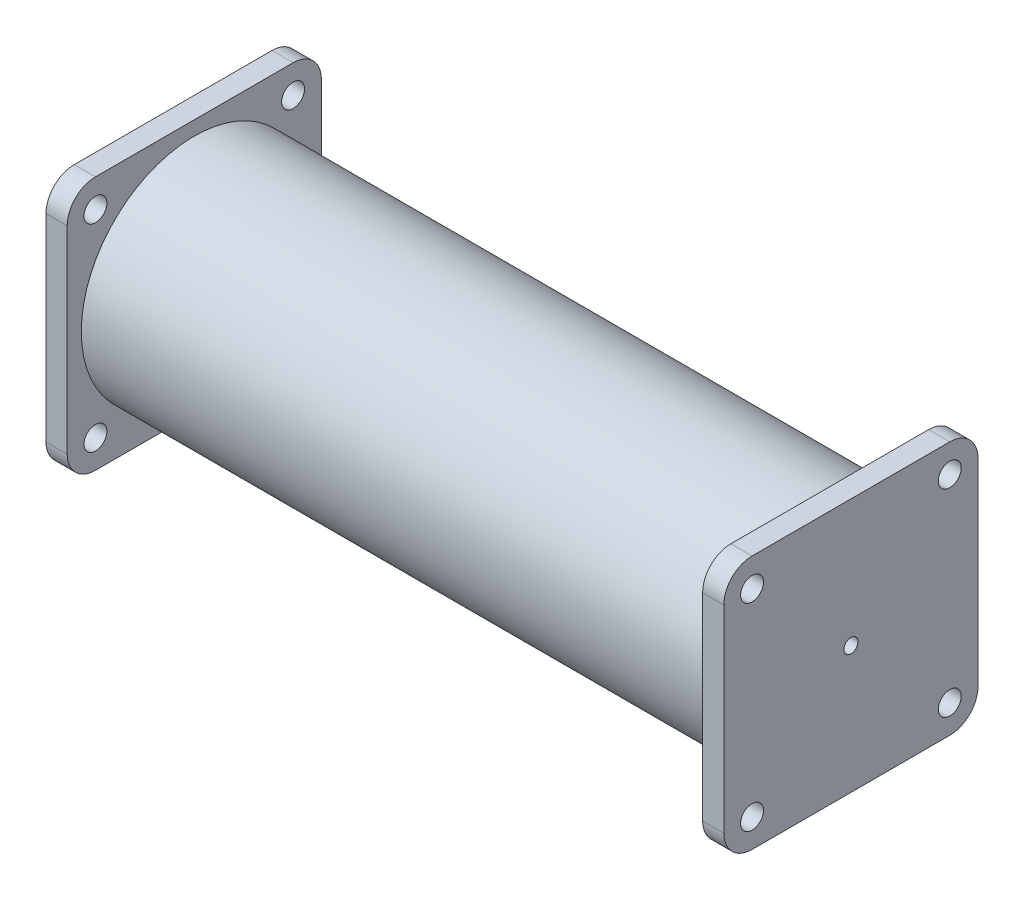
ISO-10303-21;
HEADER;
FILE_DESCRIPTION(('STEP AP214'),'2;1');
FILE_NAME('part.step','',(''),(''),'','','');
FILE_SCHEMA(('AUTOMOTIVE_DESIGN { 1 0 10303 214 1 1 1 1 }'));
ENDSEC;
DATA;
#1=APPLICATION_CONTEXT('core data for automotive mechanical design processes');
#2=APPLICATION_PROTOCOL_DEFINITION('international standard','automotive_design',2000,#1);
#3=PRODUCT_CONTEXT('',#1,'mechanical');
#4=PRODUCT('Part','Part','',(#3));
#5=PRODUCT_RELATED_PRODUCT_CATEGORY('part','',(#4));
#6=PRODUCT_DEFINITION_FORMATION('','',#4);
#7=PRODUCT_DEFINITION_CONTEXT('part definition',#1,'design');
#8=PRODUCT_DEFINITION('design','',#6,#7);
#9=PRODUCT_DEFINITION_SHAPE('','',#8);
#10=(LENGTH_UNIT() NAMED_UNIT(*) SI_UNIT(.MILLI.,.METRE.));
#11=(NAMED_UNIT(*) PLANE_ANGLE_UNIT() SI_UNIT($,.RADIAN.));
#12=(NAMED_UNIT(*) SI_UNIT($,.STERADIAN.) SOLID_ANGLE_UNIT());
#13=UNCERTAINTY_MEASURE_WITH_UNIT(LENGTH_MEASURE(1.E-05),#10,'distance_accuracy_value','');
#14=(GEOMETRIC_REPRESENTATION_CONTEXT(3) GLOBAL_UNCERTAINTY_ASSIGNED_CONTEXT((#13)) GLOBAL_UNIT_ASSIGNED_CONTEXT((#10,
#11,#12)) REPRESENTATION_CONTEXT('',''));
#15=CARTESIAN_POINT('',(0.,0.,0.));
#16=DIRECTION('',(0.,0.,1.));
#17=DIRECTION('',(1.,0.,0.));
#18=AXIS2_PLACEMENT_3D('',#15,#16,#17);
#19=CARTESIAN_POINT('',(146.05,0.,0.));
#20=DIRECTION('',(-1.,0.,0.));
#21=DIRECTION('',(0.,0.,1.));
#22=AXIS2_PLACEMENT_3D('',#19,#20,#21);
#23=CYLINDRICAL_SURFACE('',#22,50.8);
#24=CARTESIAN_POINT('',(-142.875,0.,0.));
#25=DIRECTION('',(-1.,0.,0.));
#26=DIRECTION('',(0.,0.,1.));
#27=AXIS2_PLACEMENT_3D('',#24,#25,#26);
#28=CIRCLE('',#27,50.8);
#29=CARTESIAN_POINT('',(-142.875,0.,50.8));
#30=VERTEX_POINT('',#29);
#31=EDGE_CURVE('E172',#30,#30,#28,.T.);
#32=ORIENTED_EDGE('',*,*,#31,.F.);
#33=EDGE_LOOP('',(#32));
#34=FACE_BOUND('',#33,.T.);
#35=CARTESIAN_POINT('',(142.875,0.,0.));
#36=DIRECTION('',(1.,0.,0.));
#37=DIRECTION('',(0.,0.,-1.));
#38=AXIS2_PLACEMENT_3D('',#35,#36,#37);
#39=CIRCLE('',#38,50.8);
#40=CARTESIAN_POINT('',(142.875,0.,-50.8));
#41=VERTEX_POINT('',#40);
#42=EDGE_CURVE('E168',#41,#41,#39,.T.);
#43=ORIENTED_EDGE('',*,*,#42,.F.);
#44=EDGE_LOOP('',(#43));
#45=FACE_BOUND('',#44,.T.);
#46=ADVANCED_FACE('F31',(#34,#45),#23,.T.);
#47=CARTESIAN_POINT('',(-142.875,-57.15,-57.15));
#48=DIRECTION('',(-1.,0.,0.));
#49=DIRECTION('',(0.,0.,1.));
#50=AXIS2_PLACEMENT_3D('',#47,#48,#49);
#51=PLANE('',#50);
#52=CARTESIAN_POINT('',(-142.875,44.45,44.45));
#53=DIRECTION('',(-1.,0.,0.));
#54=DIRECTION('',(0.,0.,1.));
#55=AXIS2_PLACEMENT_3D('',#52,#53,#54);
#56=CIRCLE('',#55,5.1562);
#57=CARTESIAN_POINT('',(-142.875,44.45,49.6062));
#58=VERTEX_POINT('',#57);
#59=EDGE_CURVE('E476',#58,#58,#56,.T.);
#60=ORIENTED_EDGE('',*,*,#59,.T.);
#61=EDGE_LOOP('',(#60));
#62=FACE_BOUND('',#61,.T.);
#63=CARTESIAN_POINT('',(-142.875,-44.45,44.45));
#64=DIRECTION('',(-1.,0.,0.));
#65=DIRECTION('',(0.,0.,1.));
#66=AXIS2_PLACEMENT_3D('',#63,#64,#65);
#67=CIRCLE('',#66,5.1562);
#68=CARTESIAN_POINT('',(-142.875,-44.45,49.6062));
#69=VERTEX_POINT('',#68);
#70=EDGE_CURVE('E466',#69,#69,#67,.T.);
#71=ORIENTED_EDGE('',*,*,#70,.T.);
#72=EDGE_LOOP('',(#71));
#73=FACE_BOUND('',#72,.T.);
#74=CARTESIAN_POINT('',(-142.875,-44.45,-44.45));
#75=DIRECTION('',(-1.,0.,0.));
#76=DIRECTION('',(0.,0.,1.));
#77=AXIS2_PLACEMENT_3D('',#74,#75,#76);
#78=CIRCLE('',#77,5.1562);
#79=CARTESIAN_POINT('',(-142.875,-44.45,-39.2938));
#80=VERTEX_POINT('',#79);
#81=EDGE_CURVE('E456',#80,#80,#78,.T.);
#82=ORIENTED_EDGE('',*,*,#81,.T.);
#83=EDGE_LOOP('',(#82));
#84=FACE_BOUND('',#83,.T.);
#85=CARTESIAN_POINT('',(-142.875,44.45,-44.45));
#86=DIRECTION('',(-1.,0.,0.));
#87=DIRECTION('',(0.,0.,1.));
#88=AXIS2_PLACEMENT_3D('',#85,#86,#87);
#89=CIRCLE('',#88,5.1562);
#90=CARTESIAN_POINT('',(-142.875,44.45,-39.2938));
#91=VERTEX_POINT('',#90);
#92=EDGE_CURVE('E444',#91,#91,#89,.T.);
#93=ORIENTED_EDGE('',*,*,#92,.T.);
#94=EDGE_LOOP('',(#93));
#95=FACE_BOUND('',#94,.T.);
#96=DIRECTION('',(0.,0.,1.));
#97=VECTOR('',#96,1.);
#98=CARTESIAN_POINT('',(-142.875,-57.15,57.15));
#99=LINE('',#98,#97);
#100=CARTESIAN_POINT('',(-142.875,-57.15,-44.45));
#101=VERTEX_POINT('',#100);
#102=CARTESIAN_POINT('',(-142.875,-57.15,44.45));
#103=VERTEX_POINT('',#102);
#104=EDGE_CURVE('E163',#101,#103,#99,.T.);
#105=ORIENTED_EDGE('',*,*,#104,.F.);
#106=CARTESIAN_POINT('',(-142.875,-44.45,-44.45));
#107=DIRECTION('',(-1.,0.,0.));
#108=DIRECTION('',(0.,0.,1.));
#109=AXIS2_PLACEMENT_3D('',#106,#107,#108);
#110=CIRCLE('',#109,12.7);
#111=CARTESIAN_POINT('',(-142.875,-44.45,-57.15));
#112=VERTEX_POINT('',#111);
#113=EDGE_CURVE('E193',#101,#112,#110,.F.);
#114=ORIENTED_EDGE('',*,*,#113,.T.);
#115=DIRECTION('',(0.,-1.,0.));
#116=VECTOR('',#115,1.);
#117=CARTESIAN_POINT('',(-142.875,57.15,-57.15));
#118=LINE('',#117,#116);
#119=CARTESIAN_POINT('',(-142.875,44.45,-57.15));
#120=VERTEX_POINT('',#119);
#121=EDGE_CURVE('E280',#120,#112,#118,.T.);
#122=ORIENTED_EDGE('',*,*,#121,.F.);
#123=CARTESIAN_POINT('',(-142.875,44.45,-44.45));
#124=DIRECTION('',(-1.,0.,0.));
#125=DIRECTION('',(0.,0.,1.));
#126=AXIS2_PLACEMENT_3D('',#123,#124,#125);
#127=CIRCLE('',#126,12.7);
#128=CARTESIAN_POINT('',(-142.875,57.15,-44.45));
#129=VERTEX_POINT('',#128);
#130=EDGE_CURVE('E167',#120,#129,#127,.F.);
#131=ORIENTED_EDGE('',*,*,#130,.T.);
#132=DIRECTION('',(0.,0.,-1.));
#133=VECTOR('',#132,1.);
#134=CARTESIAN_POINT('',(-142.875,57.15,57.15));
#135=LINE('',#134,#133);
#136=CARTESIAN_POINT('',(-142.875,57.15,44.45));
#137=VERTEX_POINT('',#136);
#138=EDGE_CURVE('E277',#137,#129,#135,.T.);
#139=ORIENTED_EDGE('',*,*,#138,.F.);
#140=CARTESIAN_POINT('',(-142.875,44.45,44.45));
#141=DIRECTION('',(-1.,0.,0.));
#142=DIRECTION('',(0.,0.,1.));
#143=AXIS2_PLACEMENT_3D('',#140,#141,#142);
#144=CIRCLE('',#143,12.7);
#145=CARTESIAN_POINT('',(-142.875,44.45,57.15));
#146=VERTEX_POINT('',#145);
#147=EDGE_CURVE('E189',#137,#146,#144,.F.);
#148=ORIENTED_EDGE('',*,*,#147,.T.);
#149=DIRECTION('',(0.,1.,0.));
#150=VECTOR('',#149,1.);
#151=CARTESIAN_POINT('',(-142.875,57.15,57.15));
#152=LINE('',#151,#150);
#153=CARTESIAN_POINT('',(-142.875,-44.45,57.15));
#154=VERTEX_POINT('',#153);
#155=EDGE_CURVE('E274',#154,#146,#152,.T.);
#156=ORIENTED_EDGE('',*,*,#155,.F.);
#157=CARTESIAN_POINT('',(-142.875,-44.45,44.45));
#158=DIRECTION('',(-1.,0.,0.));
#159=DIRECTION('',(0.,0.,1.));
#160=AXIS2_PLACEMENT_3D('',#157,#158,#159);
#161=CIRCLE('',#160,12.7);
#162=EDGE_CURVE('E191',#154,#103,#161,.F.);
#163=ORIENTED_EDGE('',*,*,#162,.T.);
#164=EDGE_LOOP('',(#105,#114,#122,#131,#139,#148,#156,#163));
#165=FACE_BOUND('',#164,.T.);
#166=ORIENTED_EDGE('',*,*,#31,.T.);
#167=EDGE_LOOP('',(#166));
#168=FACE_BOUND('',#167,.T.);
#169=ADVANCED_FACE('F314',(#62,#73,#84,#95,#165,#168),#51,.F.);
#170=CARTESIAN_POINT('',(-142.875,-57.15,57.15));
#171=DIRECTION('',(0.,-1.,0.));
#172=DIRECTION('',(0.,0.,-1.));
#173=AXIS2_PLACEMENT_3D('',#170,#171,#172);
#174=PLANE('',#173);
#175=DIRECTION('',(0.,0.,1.));
#176=VECTOR('',#175,1.);
#177=CARTESIAN_POINT('',(-152.4,-57.15,57.15));
#178=LINE('',#177,#176);
#179=CARTESIAN_POINT('',(-152.4,-57.15,-44.45));
#180=VERTEX_POINT('',#179);
#181=CARTESIAN_POINT('',(-152.4,-57.15,44.45));
#182=VERTEX_POINT('',#181);
#183=EDGE_CURVE('E265',#180,#182,#178,.T.);
#184=ORIENTED_EDGE('',*,*,#183,.F.);
#185=DIRECTION('',(-1.,0.,0.));
#186=VECTOR('',#185,1.);
#187=CARTESIAN_POINT('',(-142.875,-57.15,-44.45));
#188=LINE('',#187,#186);
#189=EDGE_CURVE('E186',#180,#101,#188,.F.);
#190=ORIENTED_EDGE('',*,*,#189,.T.);
#191=ORIENTED_EDGE('',*,*,#104,.T.);
#192=DIRECTION('',(-1.,0.,0.));
#193=VECTOR('',#192,1.);
#194=CARTESIAN_POINT('',(-142.875,-57.15,44.45));
#195=LINE('',#194,#193);
#196=EDGE_CURVE('E183',#103,#182,#195,.T.);
#197=ORIENTED_EDGE('',*,*,#196,.T.);
#198=EDGE_LOOP('',(#184,#190,#191,#197));
#199=FACE_BOUND('',#198,.T.);
#200=ADVANCED_FACE('F319',(#199),#174,.T.);
#201=CARTESIAN_POINT('',(-142.875,57.15,-57.15));
#202=DIRECTION('',(0.,0.,-1.));
#203=DIRECTION('',(-1.,0.,0.));
#204=AXIS2_PLACEMENT_3D('',#201,#202,#203);
#205=PLANE('',#204);
#206=ORIENTED_EDGE('',*,*,#121,.T.);
#207=DIRECTION('',(-1.,0.,0.));
#208=VECTOR('',#207,1.);
#209=CARTESIAN_POINT('',(-142.875,-44.45,-57.15));
#210=LINE('',#209,#208);
#211=CARTESIAN_POINT('',(-152.4,-44.45,-57.15));
#212=VERTEX_POINT('',#211);
#213=EDGE_CURVE('E154',#112,#212,#210,.T.);
#214=ORIENTED_EDGE('',*,*,#213,.T.);
#215=DIRECTION('',(0.,-1.,0.));
#216=VECTOR('',#215,1.);
#217=CARTESIAN_POINT('',(-152.4,57.15,-57.15));
#218=LINE('',#217,#216);
#219=CARTESIAN_POINT('',(-152.4,44.45,-57.15));
#220=VERTEX_POINT('',#219);
#221=EDGE_CURVE('E146',#220,#212,#218,.T.);
#222=ORIENTED_EDGE('',*,*,#221,.F.);
#223=DIRECTION('',(-1.,0.,0.));
#224=VECTOR('',#223,1.);
#225=CARTESIAN_POINT('',(-142.875,44.45,-57.15));
#226=LINE('',#225,#224);
#227=EDGE_CURVE('E160',#220,#120,#226,.F.);
#228=ORIENTED_EDGE('',*,*,#227,.T.);
#229=EDGE_LOOP('',(#206,#214,#222,#228));
#230=FACE_BOUND('',#229,.T.);
#231=ADVANCED_FACE('F159',(#230),#205,.T.);
#232=CARTESIAN_POINT('',(-142.875,57.15,57.15));
#233=DIRECTION('',(0.,1.,0.));
#234=DIRECTION('',(0.,0.,1.));
#235=AXIS2_PLACEMENT_3D('',#232,#233,#234);
#236=PLANE('',#235);
#237=DIRECTION('',(0.,0.,-1.));
#238=VECTOR('',#237,1.);
#239=CARTESIAN_POINT('',(-152.4,57.15,57.15));
#240=LINE('',#239,#238);
#241=CARTESIAN_POINT('',(-152.4,57.15,44.45));
#242=VERTEX_POINT('',#241);
#243=CARTESIAN_POINT('',(-152.4,57.15,-44.45));
#244=VERTEX_POINT('',#243);
#245=EDGE_CURVE('E148',#242,#244,#240,.T.);
#246=ORIENTED_EDGE('',*,*,#245,.F.);
#247=DIRECTION('',(-1.,0.,0.));
#248=VECTOR('',#247,1.);
#249=CARTESIAN_POINT('',(-142.875,57.15,44.45));
#250=LINE('',#249,#248);
#251=EDGE_CURVE('E202',#242,#137,#250,.F.);
#252=ORIENTED_EDGE('',*,*,#251,.T.);
#253=ORIENTED_EDGE('',*,*,#138,.T.);
#254=DIRECTION('',(-1.,0.,0.));
#255=VECTOR('',#254,1.);
#256=CARTESIAN_POINT('',(-142.875,57.15,-44.45));
#257=LINE('',#256,#255);
#258=EDGE_CURVE('E200',#129,#244,#257,.T.);
#259=ORIENTED_EDGE('',*,*,#258,.T.);
#260=EDGE_LOOP('',(#246,#252,#253,#259));
#261=FACE_BOUND('',#260,.T.);
#262=ADVANCED_FACE('F517',(#261),#236,.T.);
#263=CARTESIAN_POINT('',(-142.875,57.15,57.15));
#264=DIRECTION('',(0.,0.,1.));
#265=DIRECTION('',(1.,0.,0.));
#266=AXIS2_PLACEMENT_3D('',#263,#264,#265);
#267=PLANE('',#266);
#268=DIRECTION('',(0.,1.,0.));
#269=VECTOR('',#268,1.);
#270=CARTESIAN_POINT('',(-152.4,57.15,57.15));
#271=LINE('',#270,#269);
#272=CARTESIAN_POINT('',(-152.4,-44.45,57.15));
#273=VERTEX_POINT('',#272);
#274=CARTESIAN_POINT('',(-152.4,44.45,57.15));
#275=VERTEX_POINT('',#274);
#276=EDGE_CURVE('E268',#273,#275,#271,.T.);
#277=ORIENTED_EDGE('',*,*,#276,.F.);
#278=DIRECTION('',(-1.,0.,0.));
#279=VECTOR('',#278,1.);
#280=CARTESIAN_POINT('',(-142.875,-44.45,57.15));
#281=LINE('',#280,#279);
#282=EDGE_CURVE('E198',#273,#154,#281,.F.);
#283=ORIENTED_EDGE('',*,*,#282,.T.);
#284=ORIENTED_EDGE('',*,*,#155,.T.);
#285=DIRECTION('',(-1.,0.,0.));
#286=VECTOR('',#285,1.);
#287=CARTESIAN_POINT('',(-142.875,44.45,57.15));
#288=LINE('',#287,#286);
#289=EDGE_CURVE('E195',#146,#275,#288,.T.);
#290=ORIENTED_EDGE('',*,*,#289,.T.);
#291=EDGE_LOOP('',(#277,#283,#284,#290));
#292=FACE_BOUND('',#291,.T.);
#293=ADVANCED_FACE('F489',(#292),#267,.T.);
#294=CARTESIAN_POINT('',(-152.4,0.,0.));
#295=DIRECTION('',(-1.,0.,0.));
#296=DIRECTION('',(0.,0.,1.));
#297=AXIS2_PLACEMENT_3D('',#294,#295,#296);
#298=PLANE('',#297);
#299=CARTESIAN_POINT('',(-152.4,44.45,44.45));
#300=DIRECTION('',(-1.,0.,0.));
#301=DIRECTION('',(0.,0.,-1.));
#302=AXIS2_PLACEMENT_3D('',#299,#300,#301);
#303=CIRCLE('',#302,5.1562);
#304=CARTESIAN_POINT('',(-152.4,44.45,39.2938));
#305=VERTEX_POINT('',#304);
#306=EDGE_CURVE('E482',#305,#305,#303,.T.);
#307=ORIENTED_EDGE('',*,*,#306,.F.);
#308=EDGE_LOOP('',(#307));
#309=FACE_BOUND('',#308,.T.);
#310=CARTESIAN_POINT('',(-152.4,-44.45,44.45));
#311=DIRECTION('',(-1.,0.,0.));
#312=DIRECTION('',(0.,0.,1.));
#313=AXIS2_PLACEMENT_3D('',#310,#311,#312);
#314=CIRCLE('',#313,5.1562);
#315=CARTESIAN_POINT('',(-152.4,-44.45,49.6062));
#316=VERTEX_POINT('',#315);
#317=EDGE_CURVE('E473',#316,#316,#314,.T.);
#318=ORIENTED_EDGE('',*,*,#317,.F.);
#319=EDGE_LOOP('',(#318));
#320=FACE_BOUND('',#319,.T.);
#321=CARTESIAN_POINT('',(-152.4,-44.45,-44.45));
#322=DIRECTION('',(-1.,0.,0.));
#323=DIRECTION('',(0.,0.,-1.));
#324=AXIS2_PLACEMENT_3D('',#321,#322,#323);
#325=CIRCLE('',#324,5.1562);
#326=CARTESIAN_POINT('',(-152.4,-44.45,-49.6062));
#327=VERTEX_POINT('',#326);
#328=EDGE_CURVE('E463',#327,#327,#325,.T.);
#329=ORIENTED_EDGE('',*,*,#328,.F.);
#330=EDGE_LOOP('',(#329));
#331=FACE_BOUND('',#330,.T.);
#332=CARTESIAN_POINT('',(-152.4,44.45,-44.45));
#333=DIRECTION('',(-1.,0.,0.));
#334=DIRECTION('',(0.,0.,1.));
#335=AXIS2_PLACEMENT_3D('',#332,#333,#334);
#336=CIRCLE('',#335,5.1562);
#337=CARTESIAN_POINT('',(-152.4,44.45,-39.2938));
#338=VERTEX_POINT('',#337);
#339=EDGE_CURVE('E453',#338,#338,#336,.T.);
#340=ORIENTED_EDGE('',*,*,#339,.F.);
#341=EDGE_LOOP('',(#340));
#342=FACE_BOUND('',#341,.T.);
#343=CARTESIAN_POINT('',(-152.4,0.,0.));
#344=DIRECTION('',(-1.,0.,0.));
#345=DIRECTION('',(0.,0.,1.));
#346=AXIS2_PLACEMENT_3D('',#343,#344,#345);
#347=CIRCLE('',#346,3.175);
#348=CARTESIAN_POINT('',(-152.4,0.,3.175));
#349=VERTEX_POINT('',#348);
#350=EDGE_CURVE('E351',#349,#349,#347,.T.);
#351=ORIENTED_EDGE('',*,*,#350,.F.);
#352=EDGE_LOOP('',(#351));
#353=FACE_BOUND('',#352,.T.);
#354=ORIENTED_EDGE('',*,*,#221,.T.);
#355=CARTESIAN_POINT('',(-152.4,-44.45,-44.45));
#356=DIRECTION('',(-1.,0.,0.));
#357=DIRECTION('',(0.,0.,1.));
#358=AXIS2_PLACEMENT_3D('',#355,#356,#357);
#359=CIRCLE('',#358,12.7);
#360=EDGE_CURVE('E181',#212,#180,#359,.T.);
#361=ORIENTED_EDGE('',*,*,#360,.T.);
#362=ORIENTED_EDGE('',*,*,#183,.T.);
#363=CARTESIAN_POINT('',(-152.4,-44.45,44.45));
#364=DIRECTION('',(-1.,0.,0.));
#365=DIRECTION('',(0.,0.,1.));
#366=AXIS2_PLACEMENT_3D('',#363,#364,#365);
#367=CIRCLE('',#366,12.7);
#368=EDGE_CURVE('E179',#182,#273,#367,.T.);
#369=ORIENTED_EDGE('',*,*,#368,.T.);
#370=ORIENTED_EDGE('',*,*,#276,.T.);
#371=CARTESIAN_POINT('',(-152.4,44.45,44.45));
#372=DIRECTION('',(-1.,0.,0.));
#373=DIRECTION('',(0.,0.,1.));
#374=AXIS2_PLACEMENT_3D('',#371,#372,#373);
#375=CIRCLE('',#374,12.7);
#376=EDGE_CURVE('E153',#275,#242,#375,.T.);
#377=ORIENTED_EDGE('',*,*,#376,.T.);
#378=ORIENTED_EDGE('',*,*,#245,.T.);
#379=CARTESIAN_POINT('',(-152.4,44.45,-44.45));
#380=DIRECTION('',(-1.,0.,0.));
#381=DIRECTION('',(0.,0.,1.));
#382=AXIS2_PLACEMENT_3D('',#379,#380,#381);
#383=CIRCLE('',#382,12.7);
#384=EDGE_CURVE('E143',#244,#220,#383,.T.);
#385=ORIENTED_EDGE('',*,*,#384,.T.);
#386=EDGE_LOOP('',(#354,#361,#362,#369,#370,#377,#378,#385));
#387=FACE_BOUND('',#386,.T.);
#388=ADVANCED_FACE('F145',(#309,#320,#331,#342,#353,#387),#298,.T.);
#389=CARTESIAN_POINT('',(142.875,-57.15,-57.15));
#390=DIRECTION('',(1.,0.,0.));
#391=DIRECTION('',(0.,0.,1.));
#392=AXIS2_PLACEMENT_3D('',#389,#390,#391);
#393=PLANE('',#392);
#394=CARTESIAN_POINT('',(142.875,44.45,44.45));
#395=DIRECTION('',(1.,0.,0.));
#396=DIRECTION('',(0.,0.,-1.));
#397=AXIS2_PLACEMENT_3D('',#394,#395,#396);
#398=CIRCLE('',#397,5.1562);
#399=CARTESIAN_POINT('',(142.875,44.45,39.2938));
#400=VERTEX_POINT('',#399);
#401=EDGE_CURVE('E478',#400,#400,#398,.T.);
#402=ORIENTED_EDGE('',*,*,#401,.T.);
#403=EDGE_LOOP('',(#402));
#404=FACE_BOUND('',#403,.T.);
#405=CARTESIAN_POINT('',(142.875,-44.45,44.45));
#406=DIRECTION('',(1.,0.,0.));
#407=DIRECTION('',(0.,0.,-1.));
#408=AXIS2_PLACEMENT_3D('',#405,#406,#407);
#409=CIRCLE('',#408,5.1562);
#410=CARTESIAN_POINT('',(142.875,-44.45,39.2938));
#411=VERTEX_POINT('',#410);
#412=EDGE_CURVE('E469',#411,#411,#409,.T.);
#413=ORIENTED_EDGE('',*,*,#412,.T.);
#414=EDGE_LOOP('',(#413));
#415=FACE_BOUND('',#414,.T.);
#416=CARTESIAN_POINT('',(142.875,-44.45,-44.45));
#417=DIRECTION('',(1.,0.,0.));
#418=DIRECTION('',(0.,0.,-1.));
#419=AXIS2_PLACEMENT_3D('',#416,#417,#418);
#420=CIRCLE('',#419,5.1562);
#421=CARTESIAN_POINT('',(142.875,-44.45,-49.6062));
#422=VERTEX_POINT('',#421);
#423=EDGE_CURVE('E459',#422,#422,#420,.T.);
#424=ORIENTED_EDGE('',*,*,#423,.T.);
#425=EDGE_LOOP('',(#424));
#426=FACE_BOUND('',#425,.T.);
#427=CARTESIAN_POINT('',(142.875,44.45,-44.45));
#428=DIRECTION('',(1.,0.,0.));
#429=DIRECTION('',(0.,0.,-1.));
#430=AXIS2_PLACEMENT_3D('',#427,#428,#429);
#431=CIRCLE('',#430,5.1562);
#432=CARTESIAN_POINT('',(142.875,44.45,-49.6062));
#433=VERTEX_POINT('',#432);
#434=EDGE_CURVE('E446',#433,#433,#431,.T.);
#435=ORIENTED_EDGE('',*,*,#434,.T.);
#436=EDGE_LOOP('',(#435));
#437=FACE_BOUND('',#436,.T.);
#438=DIRECTION('',(0.,-1.,0.));
#439=VECTOR('',#438,1.);
#440=CARTESIAN_POINT('',(142.875,57.15,-57.15));
#441=LINE('',#440,#439);
#442=CARTESIAN_POINT('',(142.875,44.45,-57.15));
#443=VERTEX_POINT('',#442);
#444=CARTESIAN_POINT('',(142.875,-44.45,-57.15));
#445=VERTEX_POINT('',#444);
#446=EDGE_CURVE('E258',#443,#445,#441,.T.);
#447=ORIENTED_EDGE('',*,*,#446,.T.);
#448=CARTESIAN_POINT('',(142.875,-44.45,-44.45));
#449=DIRECTION('',(1.,0.,0.));
#450=DIRECTION('',(0.,0.,-1.));
#451=AXIS2_PLACEMENT_3D('',#448,#449,#450);
#452=CIRCLE('',#451,12.7);
#453=CARTESIAN_POINT('',(142.875,-57.15,-44.45));
#454=VERTEX_POINT('',#453);
#455=EDGE_CURVE('E227',#445,#454,#452,.F.);
#456=ORIENTED_EDGE('',*,*,#455,.T.);
#457=DIRECTION('',(0.,0.,1.));
#458=VECTOR('',#457,1.);
#459=CARTESIAN_POINT('',(142.875,-57.15,57.15));
#460=LINE('',#459,#458);
#461=CARTESIAN_POINT('',(142.875,-57.15,44.45));
#462=VERTEX_POINT('',#461);
#463=EDGE_CURVE('E249',#454,#462,#460,.T.);
#464=ORIENTED_EDGE('',*,*,#463,.T.);
#465=CARTESIAN_POINT('',(142.875,-44.45,44.45));
#466=DIRECTION('',(1.,0.,0.));
#467=DIRECTION('',(0.,0.,-1.));
#468=AXIS2_PLACEMENT_3D('',#465,#466,#467);
#469=CIRCLE('',#468,12.7);
#470=CARTESIAN_POINT('',(142.875,-44.45,57.15));
#471=VERTEX_POINT('',#470);
#472=EDGE_CURVE('E225',#462,#471,#469,.F.);
#473=ORIENTED_EDGE('',*,*,#472,.T.);
#474=DIRECTION('',(0.,1.,0.));
#475=VECTOR('',#474,1.);
#476=CARTESIAN_POINT('',(142.875,57.15,57.15));
#477=LINE('',#476,#475);
#478=CARTESIAN_POINT('',(142.875,44.45,57.15));
#479=VERTEX_POINT('',#478);
#480=EDGE_CURVE('E262',#471,#479,#477,.T.);
#481=ORIENTED_EDGE('',*,*,#480,.T.);
#482=CARTESIAN_POINT('',(142.875,44.45,44.45));
#483=DIRECTION('',(1.,0.,0.));
#484=DIRECTION('',(0.,0.,-1.));
#485=AXIS2_PLACEMENT_3D('',#482,#483,#484);
#486=CIRCLE('',#485,12.7);
#487=CARTESIAN_POINT('',(142.875,57.15,44.45));
#488=VERTEX_POINT('',#487);
#489=EDGE_CURVE('E50',#479,#488,#486,.F.);
#490=ORIENTED_EDGE('',*,*,#489,.T.);
#491=DIRECTION('',(0.,0.,-1.));
#492=VECTOR('',#491,1.);
#493=CARTESIAN_POINT('',(142.875,57.15,57.15));
#494=LINE('',#493,#492);
#495=CARTESIAN_POINT('',(142.875,57.15,-44.45));
#496=VERTEX_POINT('',#495);
#497=EDGE_CURVE('E238',#488,#496,#494,.T.);
#498=ORIENTED_EDGE('',*,*,#497,.T.);
#499=CARTESIAN_POINT('',(142.875,44.45,-44.45));
#500=DIRECTION('',(1.,0.,0.));
#501=DIRECTION('',(0.,0.,-1.));
#502=AXIS2_PLACEMENT_3D('',#499,#500,#501);
#503=CIRCLE('',#502,12.7);
#504=EDGE_CURVE('E223',#496,#443,#503,.F.);
#505=ORIENTED_EDGE('',*,*,#504,.T.);
#506=EDGE_LOOP('',(#447,#456,#464,#473,#481,#490,#498,#505));
#507=FACE_BOUND('',#506,.T.);
#508=ORIENTED_EDGE('',*,*,#42,.T.);
#509=EDGE_LOOP('',(#508));
#510=FACE_BOUND('',#509,.T.);
#511=ADVANCED_FACE('F296',(#404,#415,#426,#437,#507,#510),#393,.F.);
#512=CARTESIAN_POINT('',(142.875,-57.15,57.15));
#513=DIRECTION('',(0.,1.,0.));
#514=DIRECTION('',(0.,0.,1.));
#515=AXIS2_PLACEMENT_3D('',#512,#513,#514);
#516=PLANE('',#515);
#517=ORIENTED_EDGE('',*,*,#463,.F.);
#518=DIRECTION('',(1.,0.,0.));
#519=VECTOR('',#518,1.);
#520=CARTESIAN_POINT('',(142.875,-57.15,-44.45));
#521=LINE('',#520,#519);
#522=CARTESIAN_POINT('',(152.4,-57.15,-44.45));
#523=VERTEX_POINT('',#522);
#524=EDGE_CURVE('E206',#454,#523,#521,.T.);
#525=ORIENTED_EDGE('',*,*,#524,.T.);
#526=DIRECTION('',(0.,0.,1.));
#527=VECTOR('',#526,1.);
#528=CARTESIAN_POINT('',(152.4,-57.15,57.15));
#529=LINE('',#528,#527);
#530=CARTESIAN_POINT('',(152.4,-57.15,44.45));
#531=VERTEX_POINT('',#530);
#532=EDGE_CURVE('E252',#523,#531,#529,.T.);
#533=ORIENTED_EDGE('',*,*,#532,.T.);
#534=DIRECTION('',(1.,0.,0.));
#535=VECTOR('',#534,1.);
#536=CARTESIAN_POINT('',(142.875,-57.15,44.45));
#537=LINE('',#536,#535);
#538=EDGE_CURVE('E204',#531,#462,#537,.F.);
#539=ORIENTED_EDGE('',*,*,#538,.T.);
#540=EDGE_LOOP('',(#517,#525,#533,#539));
#541=FACE_BOUND('',#540,.T.);
#542=ADVANCED_FACE('F311',(#541),#516,.F.);
#543=CARTESIAN_POINT('',(142.875,57.15,57.15));
#544=DIRECTION('',(0.,0.,-1.));
#545=DIRECTION('',(-1.,0.,0.));
#546=AXIS2_PLACEMENT_3D('',#543,#544,#545);
#547=PLANE('',#546);
#548=ORIENTED_EDGE('',*,*,#480,.F.);
#549=DIRECTION('',(1.,0.,0.));
#550=VECTOR('',#549,1.);
#551=CARTESIAN_POINT('',(142.875,-44.45,57.15));
#552=LINE('',#551,#550);
#553=CARTESIAN_POINT('',(152.4,-44.45,57.15));
#554=VERTEX_POINT('',#553);
#555=EDGE_CURVE('E231',#471,#554,#552,.T.);
#556=ORIENTED_EDGE('',*,*,#555,.T.);
#557=DIRECTION('',(0.,1.,0.));
#558=VECTOR('',#557,1.);
#559=CARTESIAN_POINT('',(152.4,57.15,57.15));
#560=LINE('',#559,#558);
#561=CARTESIAN_POINT('',(152.4,44.45,57.15));
#562=VERTEX_POINT('',#561);
#563=EDGE_CURVE('E246',#554,#562,#560,.T.);
#564=ORIENTED_EDGE('',*,*,#563,.T.);
#565=DIRECTION('',(1.,0.,0.));
#566=VECTOR('',#565,1.);
#567=CARTESIAN_POINT('',(142.875,44.45,57.15));
#568=LINE('',#567,#566);
#569=EDGE_CURVE('E229',#562,#479,#568,.F.);
#570=ORIENTED_EDGE('',*,*,#569,.T.);
#571=EDGE_LOOP('',(#548,#556,#564,#570));
#572=FACE_BOUND('',#571,.T.);
#573=ADVANCED_FACE('F369',(#572),#547,.F.);
#574=CARTESIAN_POINT('',(142.875,57.15,57.15));
#575=DIRECTION('',(0.,-1.,0.));
#576=DIRECTION('',(0.,0.,-1.));
#577=AXIS2_PLACEMENT_3D('',#574,#575,#576);
#578=PLANE('',#577);
#579=DIRECTION('',(0.,0.,-1.));
#580=VECTOR('',#579,1.);
#581=CARTESIAN_POINT('',(152.4,57.15,57.15));
#582=LINE('',#581,#580);
#583=CARTESIAN_POINT('',(152.4,57.15,44.45));
#584=VERTEX_POINT('',#583);
#585=CARTESIAN_POINT('',(152.4,57.15,-44.45));
#586=VERTEX_POINT('',#585);
#587=EDGE_CURVE('E237',#584,#586,#582,.T.);
#588=ORIENTED_EDGE('',*,*,#587,.T.);
#589=DIRECTION('',(1.,0.,0.));
#590=VECTOR('',#589,1.);
#591=CARTESIAN_POINT('',(142.875,57.15,-44.45));
#592=LINE('',#591,#590);
#593=EDGE_CURVE('E11',#586,#496,#592,.F.);
#594=ORIENTED_EDGE('',*,*,#593,.T.);
#595=ORIENTED_EDGE('',*,*,#497,.F.);
#596=DIRECTION('',(1.,0.,0.));
#597=VECTOR('',#596,1.);
#598=CARTESIAN_POINT('',(142.875,57.15,44.45));
#599=LINE('',#598,#597);
#600=EDGE_CURVE('E38',#488,#584,#599,.T.);
#601=ORIENTED_EDGE('',*,*,#600,.T.);
#602=EDGE_LOOP('',(#588,#594,#595,#601));
#603=FACE_BOUND('',#602,.T.);
#604=ADVANCED_FACE('F236',(#603),#578,.F.);
#605=CARTESIAN_POINT('',(142.875,57.15,-57.15));
#606=DIRECTION('',(0.,0.,1.));
#607=DIRECTION('',(1.,0.,0.));
#608=AXIS2_PLACEMENT_3D('',#605,#606,#607);
#609=PLANE('',#608);
#610=DIRECTION('',(0.,-1.,0.));
#611=VECTOR('',#610,1.);
#612=CARTESIAN_POINT('',(152.4,57.15,-57.15));
#613=LINE('',#612,#611);
#614=CARTESIAN_POINT('',(152.4,44.45,-57.15));
#615=VERTEX_POINT('',#614);
#616=CARTESIAN_POINT('',(152.4,-44.45,-57.15));
#617=VERTEX_POINT('',#616);
#618=EDGE_CURVE('E247',#615,#617,#613,.T.);
#619=ORIENTED_EDGE('',*,*,#618,.T.);
#620=DIRECTION('',(1.,0.,0.));
#621=VECTOR('',#620,1.);
#622=CARTESIAN_POINT('',(142.875,-44.45,-57.15));
#623=LINE('',#622,#621);
#624=EDGE_CURVE('E220',#617,#445,#623,.F.);
#625=ORIENTED_EDGE('',*,*,#624,.T.);
#626=ORIENTED_EDGE('',*,*,#446,.F.);
#627=DIRECTION('',(1.,0.,0.));
#628=VECTOR('',#627,1.);
#629=CARTESIAN_POINT('',(142.875,44.45,-57.15));
#630=LINE('',#629,#628);
#631=EDGE_CURVE('E217',#443,#615,#630,.T.);
#632=ORIENTED_EDGE('',*,*,#631,.T.);
#633=EDGE_LOOP('',(#619,#625,#626,#632));
#634=FACE_BOUND('',#633,.T.);
#635=ADVANCED_FACE('F417',(#634),#609,.F.);
#636=CARTESIAN_POINT('',(152.4,-57.15,-57.15));
#637=DIRECTION('',(1.,0.,0.));
#638=DIRECTION('',(0.,0.,1.));
#639=AXIS2_PLACEMENT_3D('',#636,#637,#638);
#640=PLANE('',#639);
#641=CARTESIAN_POINT('',(152.4,44.45,44.45));
#642=DIRECTION('',(-1.,0.,0.));
#643=DIRECTION('',(0.,0.,-1.));
#644=AXIS2_PLACEMENT_3D('',#641,#642,#643);
#645=CIRCLE('',#644,5.1562);
#646=CARTESIAN_POINT('',(152.4,44.45,39.2938));
#647=VERTEX_POINT('',#646);
#648=EDGE_CURVE('E429',#647,#647,#645,.T.);
#649=ORIENTED_EDGE('',*,*,#648,.T.);
#650=EDGE_LOOP('',(#649));
#651=FACE_BOUND('',#650,.T.);
#652=CARTESIAN_POINT('',(152.4,-44.45,44.45));
#653=DIRECTION('',(-1.,0.,0.));
#654=DIRECTION('',(0.,0.,1.));
#655=AXIS2_PLACEMENT_3D('',#652,#653,#654);
#656=CIRCLE('',#655,5.1562);
#657=CARTESIAN_POINT('',(152.4,-44.45,49.6062));
#658=VERTEX_POINT('',#657);
#659=EDGE_CURVE('E433',#658,#658,#656,.T.);
#660=ORIENTED_EDGE('',*,*,#659,.T.);
#661=EDGE_LOOP('',(#660));
#662=FACE_BOUND('',#661,.T.);
#663=CARTESIAN_POINT('',(152.4,-44.45,-44.45));
#664=DIRECTION('',(-1.,0.,0.));
#665=DIRECTION('',(0.,0.,-1.));
#666=AXIS2_PLACEMENT_3D('',#663,#664,#665);
#667=CIRCLE('',#666,5.1562);
#668=CARTESIAN_POINT('',(152.4,-44.45,-49.6062));
#669=VERTEX_POINT('',#668);
#670=EDGE_CURVE('E437',#669,#669,#667,.T.);
#671=ORIENTED_EDGE('',*,*,#670,.T.);
#672=EDGE_LOOP('',(#671));
#673=FACE_BOUND('',#672,.T.);
#674=CARTESIAN_POINT('',(152.4,44.45,-44.45));
#675=DIRECTION('',(-1.,0.,0.));
#676=DIRECTION('',(0.,0.,1.));
#677=AXIS2_PLACEMENT_3D('',#674,#675,#676);
#678=CIRCLE('',#677,5.1562);
#679=CARTESIAN_POINT('',(152.4,44.45,-39.2938));
#680=VERTEX_POINT('',#679);
#681=EDGE_CURVE('E441',#680,#680,#678,.T.);
#682=ORIENTED_EDGE('',*,*,#681,.T.);
#683=EDGE_LOOP('',(#682));
#684=FACE_BOUND('',#683,.T.);
#685=CARTESIAN_POINT('',(152.4,0.,0.));
#686=DIRECTION('',(-1.,0.,0.));
#687=DIRECTION('',(0.,0.,1.));
#688=AXIS2_PLACEMENT_3D('',#685,#686,#687);
#689=CIRCLE('',#688,3.175);
#690=CARTESIAN_POINT('',(152.4,0.,3.175));
#691=VERTEX_POINT('',#690);
#692=EDGE_CURVE('E355',#691,#691,#689,.T.);
#693=ORIENTED_EDGE('',*,*,#692,.T.);
#694=EDGE_LOOP('',(#693));
#695=FACE_BOUND('',#694,.T.);
#696=ORIENTED_EDGE('',*,*,#532,.F.);
#697=CARTESIAN_POINT('',(152.4,-44.45,-44.45));
#698=DIRECTION('',(1.,0.,0.));
#699=DIRECTION('',(0.,0.,-1.));
#700=AXIS2_PLACEMENT_3D('',#697,#698,#699);
#701=CIRCLE('',#700,12.7);
#702=EDGE_CURVE('E215',#523,#617,#701,.T.);
#703=ORIENTED_EDGE('',*,*,#702,.T.);
#704=ORIENTED_EDGE('',*,*,#618,.F.);
#705=CARTESIAN_POINT('',(152.4,44.45,-44.45));
#706=DIRECTION('',(1.,0.,0.));
#707=DIRECTION('',(0.,0.,-1.));
#708=AXIS2_PLACEMENT_3D('',#705,#706,#707);
#709=CIRCLE('',#708,12.7);
#710=EDGE_CURVE('E211',#615,#586,#709,.T.);
#711=ORIENTED_EDGE('',*,*,#710,.T.);
#712=ORIENTED_EDGE('',*,*,#587,.F.);
#713=CARTESIAN_POINT('',(152.4,44.45,44.45));
#714=DIRECTION('',(1.,0.,0.));
#715=DIRECTION('',(0.,0.,-1.));
#716=AXIS2_PLACEMENT_3D('',#713,#714,#715);
#717=CIRCLE('',#716,12.7);
#718=EDGE_CURVE('E209',#584,#562,#717,.T.);
#719=ORIENTED_EDGE('',*,*,#718,.T.);
#720=ORIENTED_EDGE('',*,*,#563,.F.);
#721=CARTESIAN_POINT('',(152.4,-44.45,44.45));
#722=DIRECTION('',(1.,0.,0.));
#723=DIRECTION('',(0.,0.,-1.));
#724=AXIS2_PLACEMENT_3D('',#721,#722,#723);
#725=CIRCLE('',#724,12.7);
#726=EDGE_CURVE('E213',#554,#531,#725,.T.);
#727=ORIENTED_EDGE('',*,*,#726,.T.);
#728=EDGE_LOOP('',(#696,#703,#704,#711,#712,#719,#720,#727));
#729=FACE_BOUND('',#728,.T.);
#730=ADVANCED_FACE('F242',(#651,#662,#673,#684,#695,#729),#640,.T.);
#731=CARTESIAN_POINT('',(152.4,0.,0.));
#732=DIRECTION('',(-1.,0.,0.));
#733=DIRECTION('',(0.,0.,1.));
#734=AXIS2_PLACEMENT_3D('',#731,#732,#733);
#735=CYLINDRICAL_SURFACE('',#734,3.175);
#736=ORIENTED_EDGE('',*,*,#692,.F.);
#737=EDGE_LOOP('',(#736));
#738=FACE_BOUND('',#737,.T.);
#739=CARTESIAN_POINT('',(142.875,0.,0.));
#740=DIRECTION('',(1.,0.,0.));
#741=DIRECTION('',(0.,0.,-1.));
#742=AXIS2_PLACEMENT_3D('',#739,#740,#741);
#743=CIRCLE('',#742,3.175);
#744=CARTESIAN_POINT('',(142.875,0.,-3.175));
#745=VERTEX_POINT('',#744);
#746=EDGE_CURVE('E175',#745,#745,#743,.T.);
#747=ORIENTED_EDGE('',*,*,#746,.F.);
#748=EDGE_LOOP('',(#747));
#749=FACE_BOUND('',#748,.T.);
#750=ADVANCED_FACE('F342',(#738,#749),#735,.F.);
#751=ORIENTED_EDGE('',*,*,#350,.T.);
#752=EDGE_LOOP('',(#751));
#753=FACE_BOUND('',#752,.T.);
#754=CARTESIAN_POINT('',(-142.875,0.,0.));
#755=DIRECTION('',(-1.,0.,0.));
#756=DIRECTION('',(0.,0.,1.));
#757=AXIS2_PLACEMENT_3D('',#754,#755,#756);
#758=CIRCLE('',#757,3.175);
#759=CARTESIAN_POINT('',(-142.875,0.,3.175));
#760=VERTEX_POINT('',#759);
#761=EDGE_CURVE('E348',#760,#760,#758,.T.);
#762=ORIENTED_EDGE('',*,*,#761,.F.);
#763=EDGE_LOOP('',(#762));
#764=FACE_BOUND('',#763,.T.);
#765=ADVANCED_FACE('F337',(#753,#764),#735,.F.);
#766=ORIENTED_EDGE('',*,*,#761,.T.);
#767=EDGE_LOOP('',(#766));
#768=FACE_BOUND('',#767,.T.);
#769=CARTESIAN_POINT('',(-142.875,0.,0.));
#770=DIRECTION('',(-1.,0.,0.));
#771=DIRECTION('',(0.,0.,1.));
#772=AXIS2_PLACEMENT_3D('',#769,#770,#771);
#773=CIRCLE('',#772,45.0596);
#774=CARTESIAN_POINT('',(-142.875,0.,45.0596));
#775=VERTEX_POINT('',#774);
#776=EDGE_CURVE('E282',#775,#775,#773,.T.);
#777=ORIENTED_EDGE('',*,*,#776,.F.);
#778=EDGE_LOOP('',(#777));
#779=FACE_BOUND('',#778,.T.);
#780=ADVANCED_FACE('F305',(#768,#779),#51,.F.);
#781=CARTESIAN_POINT('',(146.05,0.,0.));
#782=DIRECTION('',(-1.,0.,0.));
#783=DIRECTION('',(0.,0.,1.));
#784=AXIS2_PLACEMENT_3D('',#781,#782,#783);
#785=CYLINDRICAL_SURFACE('',#784,45.0596);
#786=ORIENTED_EDGE('',*,*,#776,.T.);
#787=EDGE_LOOP('',(#786));
#788=FACE_BOUND('',#787,.T.);
#789=CARTESIAN_POINT('',(142.875,0.,0.));
#790=DIRECTION('',(1.,0.,0.));
#791=DIRECTION('',(0.,0.,-1.));
#792=AXIS2_PLACEMENT_3D('',#789,#790,#791);
#793=CIRCLE('',#792,45.0596);
#794=CARTESIAN_POINT('',(142.875,0.,-45.0596));
#795=VERTEX_POINT('',#794);
#796=EDGE_CURVE('E263',#795,#795,#793,.T.);
#797=ORIENTED_EDGE('',*,*,#796,.T.);
#798=EDGE_LOOP('',(#797));
#799=FACE_BOUND('',#798,.T.);
#800=ADVANCED_FACE('F289',(#788,#799),#785,.F.);
#801=ORIENTED_EDGE('',*,*,#746,.T.);
#802=EDGE_LOOP('',(#801));
#803=FACE_BOUND('',#802,.T.);
#804=ORIENTED_EDGE('',*,*,#796,.F.);
#805=EDGE_LOOP('',(#804));
#806=FACE_BOUND('',#805,.T.);
#807=ADVANCED_FACE('F291',(#803,#806),#393,.F.);
#808=CARTESIAN_POINT('',(152.4,44.45,-44.45));
#809=DIRECTION('',(-1.,0.,0.));
#810=DIRECTION('',(0.,0.,1.));
#811=AXIS2_PLACEMENT_3D('',#808,#809,#810);
#812=CYLINDRICAL_SURFACE('',#811,5.1562);
#813=ORIENTED_EDGE('',*,*,#681,.F.);
#814=EDGE_LOOP('',(#813));
#815=FACE_BOUND('',#814,.T.);
#816=ORIENTED_EDGE('',*,*,#434,.F.);
#817=EDGE_LOOP('',(#816));
#818=FACE_BOUND('',#817,.T.);
#819=ADVANCED_FACE('F293',(#815,#818),#812,.F.);
#820=ORIENTED_EDGE('',*,*,#339,.T.);
#821=EDGE_LOOP('',(#820));
#822=FACE_BOUND('',#821,.T.);
#823=ORIENTED_EDGE('',*,*,#92,.F.);
#824=EDGE_LOOP('',(#823));
#825=FACE_BOUND('',#824,.T.);
#826=ADVANCED_FACE('F301',(#822,#825),#812,.F.);
#827=CARTESIAN_POINT('',(152.4,-44.45,-44.45));
#828=DIRECTION('',(-1.,0.,0.));
#829=DIRECTION('',(0.,0.,1.));
#830=AXIS2_PLACEMENT_3D('',#827,#828,#829);
#831=CYLINDRICAL_SURFACE('',#830,5.1562);
#832=ORIENTED_EDGE('',*,*,#670,.F.);
#833=EDGE_LOOP('',(#832));
#834=FACE_BOUND('',#833,.T.);
#835=ORIENTED_EDGE('',*,*,#423,.F.);
#836=EDGE_LOOP('',(#835));
#837=FACE_BOUND('',#836,.T.);
#838=ADVANCED_FACE('F412',(#834,#837),#831,.F.);
#839=ORIENTED_EDGE('',*,*,#328,.T.);
#840=EDGE_LOOP('',(#839));
#841=FACE_BOUND('',#840,.T.);
#842=ORIENTED_EDGE('',*,*,#81,.F.);
#843=EDGE_LOOP('',(#842));
#844=FACE_BOUND('',#843,.T.);
#845=ADVANCED_FACE('F410',(#841,#844),#831,.F.);
#846=CARTESIAN_POINT('',(152.4,-44.45,44.45));
#847=DIRECTION('',(-1.,0.,0.));
#848=DIRECTION('',(0.,0.,1.));
#849=AXIS2_PLACEMENT_3D('',#846,#847,#848);
#850=CYLINDRICAL_SURFACE('',#849,5.1562);
#851=ORIENTED_EDGE('',*,*,#659,.F.);
#852=EDGE_LOOP('',(#851));
#853=FACE_BOUND('',#852,.T.);
#854=ORIENTED_EDGE('',*,*,#412,.F.);
#855=EDGE_LOOP('',(#854));
#856=FACE_BOUND('',#855,.T.);
#857=ADVANCED_FACE('F408',(#853,#856),#850,.F.);
#858=ORIENTED_EDGE('',*,*,#317,.T.);
#859=EDGE_LOOP('',(#858));
#860=FACE_BOUND('',#859,.T.);
#861=ORIENTED_EDGE('',*,*,#70,.F.);
#862=EDGE_LOOP('',(#861));
#863=FACE_BOUND('',#862,.T.);
#864=ADVANCED_FACE('F405',(#860,#863),#850,.F.);
#865=CARTESIAN_POINT('',(152.4,44.45,44.45));
#866=DIRECTION('',(-1.,0.,0.));
#867=DIRECTION('',(0.,0.,1.));
#868=AXIS2_PLACEMENT_3D('',#865,#866,#867);
#869=CYLINDRICAL_SURFACE('',#868,5.1562);
#870=ORIENTED_EDGE('',*,*,#648,.F.);
#871=EDGE_LOOP('',(#870));
#872=FACE_BOUND('',#871,.T.);
#873=ORIENTED_EDGE('',*,*,#401,.F.);
#874=EDGE_LOOP('',(#873));
#875=FACE_BOUND('',#874,.T.);
#876=ADVANCED_FACE('F403',(#872,#875),#869,.F.);
#877=ORIENTED_EDGE('',*,*,#306,.T.);
#878=EDGE_LOOP('',(#877));
#879=FACE_BOUND('',#878,.T.);
#880=ORIENTED_EDGE('',*,*,#59,.F.);
#881=EDGE_LOOP('',(#880));
#882=FACE_BOUND('',#881,.T.);
#883=ADVANCED_FACE('F400',(#879,#882),#869,.F.);
#884=CARTESIAN_POINT('',(-142.875,-44.45,-44.45));
#885=DIRECTION('',(-1.,0.,0.));
#886=DIRECTION('',(0.,0.,1.));
#887=AXIS2_PLACEMENT_3D('',#884,#885,#886);
#888=CYLINDRICAL_SURFACE('',#887,12.7);
#889=ORIENTED_EDGE('',*,*,#113,.F.);
#890=ORIENTED_EDGE('',*,*,#189,.F.);
#891=ORIENTED_EDGE('',*,*,#360,.F.);
#892=ORIENTED_EDGE('',*,*,#213,.F.);
#893=EDGE_LOOP('',(#889,#890,#891,#892));
#894=FACE_BOUND('',#893,.T.);
#895=ADVANCED_FACE('F396',(#894),#888,.T.);
#896=CARTESIAN_POINT('',(-142.875,-44.45,44.45));
#897=DIRECTION('',(-1.,0.,0.));
#898=DIRECTION('',(0.,0.,1.));
#899=AXIS2_PLACEMENT_3D('',#896,#897,#898);
#900=CYLINDRICAL_SURFACE('',#899,12.7);
#901=ORIENTED_EDGE('',*,*,#162,.F.);
#902=ORIENTED_EDGE('',*,*,#282,.F.);
#903=ORIENTED_EDGE('',*,*,#368,.F.);
#904=ORIENTED_EDGE('',*,*,#196,.F.);
#905=EDGE_LOOP('',(#901,#902,#903,#904));
#906=FACE_BOUND('',#905,.T.);
#907=ADVANCED_FACE('F392',(#906),#900,.T.);
#908=CARTESIAN_POINT('',(-142.875,44.45,44.45));
#909=DIRECTION('',(-1.,0.,0.));
#910=DIRECTION('',(0.,0.,1.));
#911=AXIS2_PLACEMENT_3D('',#908,#909,#910);
#912=CYLINDRICAL_SURFACE('',#911,12.7);
#913=ORIENTED_EDGE('',*,*,#147,.F.);
#914=ORIENTED_EDGE('',*,*,#251,.F.);
#915=ORIENTED_EDGE('',*,*,#376,.F.);
#916=ORIENTED_EDGE('',*,*,#289,.F.);
#917=EDGE_LOOP('',(#913,#914,#915,#916));
#918=FACE_BOUND('',#917,.T.);
#919=ADVANCED_FACE('F389',(#918),#912,.T.);
#920=CARTESIAN_POINT('',(-142.875,44.45,-44.45));
#921=DIRECTION('',(-1.,0.,0.));
#922=DIRECTION('',(0.,0.,1.));
#923=AXIS2_PLACEMENT_3D('',#920,#921,#922);
#924=CYLINDRICAL_SURFACE('',#923,12.7);
#925=ORIENTED_EDGE('',*,*,#130,.F.);
#926=ORIENTED_EDGE('',*,*,#227,.F.);
#927=ORIENTED_EDGE('',*,*,#384,.F.);
#928=ORIENTED_EDGE('',*,*,#258,.F.);
#929=EDGE_LOOP('',(#925,#926,#927,#928));
#930=FACE_BOUND('',#929,.T.);
#931=ADVANCED_FACE('F166',(#930),#924,.T.);
#932=CARTESIAN_POINT('',(142.875,-44.45,-44.45));
#933=DIRECTION('',(1.,0.,0.));
#934=DIRECTION('',(0.,0.,-1.));
#935=AXIS2_PLACEMENT_3D('',#932,#933,#934);
#936=CYLINDRICAL_SURFACE('',#935,12.7);
#937=ORIENTED_EDGE('',*,*,#455,.F.);
#938=ORIENTED_EDGE('',*,*,#624,.F.);
#939=ORIENTED_EDGE('',*,*,#702,.F.);
#940=ORIENTED_EDGE('',*,*,#524,.F.);
#941=EDGE_LOOP('',(#937,#938,#939,#940));
#942=FACE_BOUND('',#941,.T.);
#943=ADVANCED_FACE('F383',(#942),#936,.T.);
#944=CARTESIAN_POINT('',(142.875,-44.45,44.45));
#945=DIRECTION('',(1.,0.,0.));
#946=DIRECTION('',(0.,0.,-1.));
#947=AXIS2_PLACEMENT_3D('',#944,#945,#946);
#948=CYLINDRICAL_SURFACE('',#947,12.7);
#949=ORIENTED_EDGE('',*,*,#472,.F.);
#950=ORIENTED_EDGE('',*,*,#538,.F.);
#951=ORIENTED_EDGE('',*,*,#726,.F.);
#952=ORIENTED_EDGE('',*,*,#555,.F.);
#953=EDGE_LOOP('',(#949,#950,#951,#952));
#954=FACE_BOUND('',#953,.T.);
#955=ADVANCED_FACE('F365',(#954),#948,.T.);
#956=CARTESIAN_POINT('',(142.875,44.45,-44.45));
#957=DIRECTION('',(1.,0.,0.));
#958=DIRECTION('',(0.,0.,-1.));
#959=AXIS2_PLACEMENT_3D('',#956,#957,#958);
#960=CYLINDRICAL_SURFACE('',#959,12.7);
#961=ORIENTED_EDGE('',*,*,#504,.F.);
#962=ORIENTED_EDGE('',*,*,#593,.F.);
#963=ORIENTED_EDGE('',*,*,#710,.F.);
#964=ORIENTED_EDGE('',*,*,#631,.F.);
#965=EDGE_LOOP('',(#961,#962,#963,#964));
#966=FACE_BOUND('',#965,.T.);
#967=ADVANCED_FACE('F373',(#966),#960,.T.);
#968=CARTESIAN_POINT('',(142.875,44.45,44.45));
#969=DIRECTION('',(1.,0.,0.));
#970=DIRECTION('',(0.,0.,-1.));
#971=AXIS2_PLACEMENT_3D('',#968,#969,#970);
#972=CYLINDRICAL_SURFACE('',#971,12.7);
#973=ORIENTED_EDGE('',*,*,#489,.F.);
#974=ORIENTED_EDGE('',*,*,#569,.F.);
#975=ORIENTED_EDGE('',*,*,#718,.F.);
#976=ORIENTED_EDGE('',*,*,#600,.F.);
#977=EDGE_LOOP('',(#973,#974,#975,#976));
#978=FACE_BOUND('',#977,.T.);
#979=ADVANCED_FACE('F371',(#978),#972,.T.);
#980=CLOSED_SHELL('',(#46,#169,#200,#231,#262,#293,#388,#511,#542,#573,#604,#635,#730,#750,#765,
#780,#800,#807,#819,#826,#838,#845,#857,#864,#876,#883,#895,#907,#919,#931,#943,#955,#967,#979));
#981=MANIFOLD_SOLID_BREP('B2',#980);
#982=ADVANCED_BREP_SHAPE_REPRESENTATION('',(#18,#981),#14);
#983=SHAPE_DEFINITION_REPRESENTATION(#9,#982);
ENDSEC;
END-ISO-10303-21;
